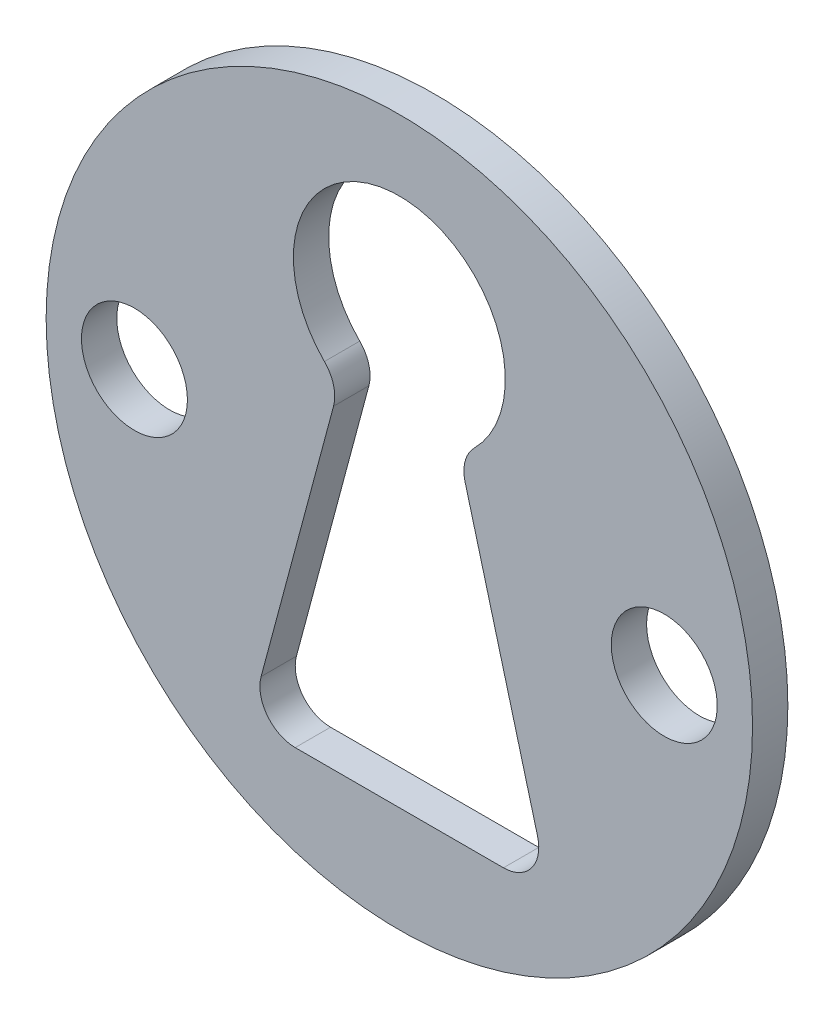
from build123d import *

# Parameters (mm, degrees)
ESQUISSE1_R      = 10
ESQUISSE1_R_2    = 1.5
EXTRUSION1_DEPTH = 1


with BuildPart() as part:
    # Esquisse1 → Extrusion1 (new body)
    with BuildSketch(Plane.XY):
        Circle(ESQUISSE1_R)
        with Locations((-7.5, 0)):
            Circle(ESQUISSE1_R_2, mode=Mode.SUBTRACT)
        with Locations(Location((7.5, 0, 0), (0, 0, 180))):
            Circle(ESQUISSE1_R_2, mode=Mode.SUBTRACT)
        with BuildLine():
            Line((-2.947441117, -7), (2.947441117, -7))
            ThreePointArc((2.947441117, -7), (3.740794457, -6.608761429), (3.913366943, -5.741180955))
            Line((3.913366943, -5.741180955), (1.862501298, 1.91275383))
            ThreePointArc((1.862501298, 1.91275383), (1.862501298, 2.43039192), (2.121320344, 2.878679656))
            ThreePointArc((2.121320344, 2.878679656), (0, 8), (-2.121320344, 2.878679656))
            ThreePointArc((-2.121320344, 2.878679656), (-1.862501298, 2.43039192), (-1.862501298, 1.91275383))
            Line((-1.862501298, 1.91275383), (-3.913366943, -5.741180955))
            ThreePointArc((-3.913366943, -5.741180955), (-3.740794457, -6.608761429), (-2.947441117, -7))
        make_face(mode=Mode.SUBTRACT)
    extrude(amount=EXTRUSION1_DEPTH)


solid = part.part
